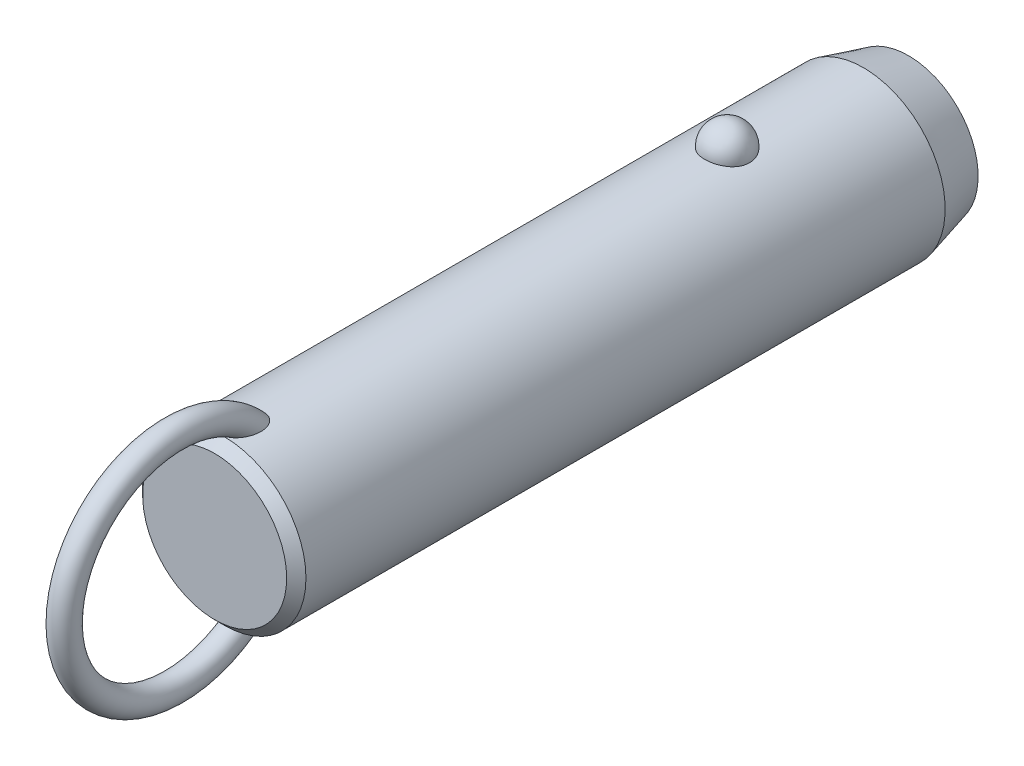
ISO-10303-21;
HEADER;
FILE_DESCRIPTION(('STEP AP214'),'2;1');
FILE_NAME('part.step','',(''),(''),'','','');
FILE_SCHEMA(('AUTOMOTIVE_DESIGN { 1 0 10303 214 1 1 1 1 }'));
ENDSEC;
DATA;
#1=APPLICATION_CONTEXT('core data for automotive mechanical design processes');
#2=APPLICATION_PROTOCOL_DEFINITION('international standard','automotive_design',2000,#1);
#3=PRODUCT_CONTEXT('',#1,'mechanical');
#4=PRODUCT('Part','Part','',(#3));
#5=PRODUCT_RELATED_PRODUCT_CATEGORY('part','',(#4));
#6=PRODUCT_DEFINITION_FORMATION('','',#4);
#7=PRODUCT_DEFINITION_CONTEXT('part definition',#1,'design');
#8=PRODUCT_DEFINITION('design','',#6,#7);
#9=PRODUCT_DEFINITION_SHAPE('','',#8);
#10=(LENGTH_UNIT() NAMED_UNIT(*) SI_UNIT(.MILLI.,.METRE.));
#11=(NAMED_UNIT(*) PLANE_ANGLE_UNIT() SI_UNIT($,.RADIAN.));
#12=(NAMED_UNIT(*) SI_UNIT($,.STERADIAN.) SOLID_ANGLE_UNIT());
#13=UNCERTAINTY_MEASURE_WITH_UNIT(LENGTH_MEASURE(1.E-05),#10,'distance_accuracy_value','');
#14=(GEOMETRIC_REPRESENTATION_CONTEXT(3) GLOBAL_UNCERTAINTY_ASSIGNED_CONTEXT((#13)) GLOBAL_UNIT_ASSIGNED_CONTEXT((#10,
#11,#12)) REPRESENTATION_CONTEXT('',''));
#15=CARTESIAN_POINT('',(0.,0.,0.));
#16=DIRECTION('',(0.,0.,1.));
#17=DIRECTION('',(1.,0.,0.));
#18=AXIS2_PLACEMENT_3D('',#15,#16,#17);
#19=CARTESIAN_POINT('',(0.,0.,63.5));
#20=DIRECTION('',(0.,0.,-1.));
#21=DIRECTION('',(-1.,0.,0.));
#22=AXIS2_PLACEMENT_3D('',#19,#20,#21);
#23=CYLINDRICAL_SURFACE('',#22,12.7);
#24=CARTESIAN_POINT('',(3.46661256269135,12.2177165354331,-3.5));
#25=CARTESIAN_POINT('',(3.4666090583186,12.2177194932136,-3.30432790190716));
#26=CARTESIAN_POINT('',(3.45063567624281,12.2222841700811,-3.10861112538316));
#27=CARTESIAN_POINT('',(3.38712451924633,12.2400345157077,-2.72271899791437));
#28=CARTESIAN_POINT('',(3.33957415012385,12.2532236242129,-2.53254588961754));
#29=CARTESIAN_POINT('',(3.2141234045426,12.286724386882,-2.16324948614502));
#30=CARTESIAN_POINT('',(3.13623639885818,12.3070329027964,-1.98412136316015));
#31=CARTESIAN_POINT('',(2.95205930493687,12.3525018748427,-1.64180592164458));
#32=CARTESIAN_POINT('',(2.84577003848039,12.3776621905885,-1.47861814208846));
#33=CARTESIAN_POINT('',(2.60688050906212,12.4301712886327,-1.17190583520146));
#34=CARTESIAN_POINT('',(2.47415697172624,12.4575299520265,-1.02847897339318));
#35=CARTESIAN_POINT('',(2.18615174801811,12.5112810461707,-0.766177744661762));
#36=CARTESIAN_POINT('',(2.03087002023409,12.5376734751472,-0.64730342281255));
#37=CARTESIAN_POINT('',(1.70237334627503,12.5864761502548,-0.437732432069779));
#38=CARTESIAN_POINT('',(1.52920948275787,12.6088972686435,-0.346958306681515));
#39=CARTESIAN_POINT('',(1.16944170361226,12.6473352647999,-0.195750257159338));
#40=CARTESIAN_POINT('',(0.982839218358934,12.663352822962,-0.135313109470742));
#41=CARTESIAN_POINT('',(0.604961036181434,12.6869706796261,-0.0473241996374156));
#42=CARTESIAN_POINT('',(0.41382314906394,12.6947125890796,-0.0192185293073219));
#43=CARTESIAN_POINT('',(0.0293827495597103,12.7014203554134,0.0051725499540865));
#44=CARTESIAN_POINT('',(-0.163919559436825,12.7003870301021,0.00146092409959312));
#45=CARTESIAN_POINT('',(-0.544374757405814,12.689735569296,-0.0373939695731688));
#46=CARTESIAN_POINT('',(-0.731575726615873,12.6802364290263,-0.0721015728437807));
#47=CARTESIAN_POINT('',(-1.09733277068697,12.6538333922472,-0.171364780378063));
#48=CARTESIAN_POINT('',(-1.27588869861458,12.6369293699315,-0.235920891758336));
#49=CARTESIAN_POINT('',(-1.6204698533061,12.5973946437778,-0.393548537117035));
#50=CARTESIAN_POINT('',(-1.78641865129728,12.5747321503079,-0.486778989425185));
#51=CARTESIAN_POINT('',(-2.10030671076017,12.5261316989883,-0.699110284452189));
#52=CARTESIAN_POINT('',(-2.24824419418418,12.5001934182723,-0.818213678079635));
#53=CARTESIAN_POINT('',(-2.52491489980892,12.4472906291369,-1.08157124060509));
#54=CARTESIAN_POINT('',(-2.65324222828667,12.4203160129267,-1.22624992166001));
#55=CARTESIAN_POINT('',(-2.88410007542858,12.3687509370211,-1.53528325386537));
#56=CARTESIAN_POINT('',(-2.98662883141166,12.3441606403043,-1.69963924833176));
#57=CARTESIAN_POINT('',(-3.16432417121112,12.2998199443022,-2.04548497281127));
#58=CARTESIAN_POINT('',(-3.23917525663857,12.2801261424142,-2.22714424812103));
#59=CARTESIAN_POINT('',(-3.35800573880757,12.248167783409,-2.6009138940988));
#60=CARTESIAN_POINT('',(-3.4019860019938,12.2359030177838,-2.79302397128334));
#61=CARTESIAN_POINT('',(-3.45784812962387,12.2202347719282,-3.18140279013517));
#62=CARTESIAN_POINT('',(-3.46986123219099,12.2167950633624,-3.37765118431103));
#63=CARTESIAN_POINT('',(-3.46186273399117,12.2190638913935,-3.76943689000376));
#64=CARTESIAN_POINT('',(-3.44185196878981,12.2247721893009,-3.96497421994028));
#65=CARTESIAN_POINT('',(-3.37048652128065,12.2446381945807,-4.34881728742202));
#66=CARTESIAN_POINT('',(-3.31928253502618,12.2587552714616,-4.53715319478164));
#67=CARTESIAN_POINT('',(-3.18693461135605,12.2938237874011,-4.90231727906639));
#68=CARTESIAN_POINT('',(-3.1057895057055,12.3147754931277,-5.07914500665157));
#69=CARTESIAN_POINT('',(-2.91506431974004,12.3613125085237,-5.41732059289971));
#70=CARTESIAN_POINT('',(-2.80533587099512,12.3869217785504,-5.57858147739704));
#71=CARTESIAN_POINT('',(-2.560414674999,12.4398525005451,-5.88013283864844));
#72=CARTESIAN_POINT('',(-2.42522099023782,12.4671740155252,-6.02042254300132));
#73=CARTESIAN_POINT('',(-2.1323357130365,12.5205965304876,-6.27662798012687));
#74=CARTESIAN_POINT('',(-1.97456596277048,12.5466928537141,-6.3924554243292));
#75=CARTESIAN_POINT('',(-1.64115839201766,12.5946384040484,-6.59583547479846));
#76=CARTESIAN_POINT('',(-1.46552179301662,12.6164879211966,-6.68339001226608));
#77=CARTESIAN_POINT('',(-1.10356050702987,12.6532533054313,-6.82682153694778));
#78=CARTESIAN_POINT('',(-0.9173913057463,12.6682500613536,-6.8830698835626));
#79=CARTESIAN_POINT('',(-0.537836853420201,12.6900288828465,-6.96386887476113));
#80=CARTESIAN_POINT('',(-0.344452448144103,12.6968119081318,-6.9884232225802));
#81=CARTESIAN_POINT('',(0.0402577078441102,12.7013667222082,-7.00496469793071));
#82=CARTESIAN_POINT('',(0.231556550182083,12.6993008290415,-6.99753844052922));
#83=CARTESIAN_POINT('',(0.610105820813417,12.6867505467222,-6.9516636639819));
#84=CARTESIAN_POINT('',(0.797356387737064,12.6762664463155,-6.913216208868));
#85=CARTESIAN_POINT('',(1.16186657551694,12.6480587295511,-6.80658431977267));
#86=CARTESIAN_POINT('',(1.33915951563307,12.6303611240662,-6.73850666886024));
#87=CARTESIAN_POINT('',(1.67968518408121,12.5896027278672,-6.5745087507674));
#88=CARTESIAN_POINT('',(1.84291705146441,12.5665416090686,-6.47858678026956));
#89=CARTESIAN_POINT('',(2.15340192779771,12.5171072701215,-6.25982455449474));
#90=CARTESIAN_POINT('',(2.30037831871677,12.4906895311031,-6.13660186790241));
#91=CARTESIAN_POINT('',(2.5717412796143,12.4376567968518,-5.86739587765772));
#92=CARTESIAN_POINT('',(2.69612388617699,12.4110417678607,-5.72140858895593));
#93=CARTESIAN_POINT('',(2.92107785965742,12.360051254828,-5.40794137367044));
#94=CARTESIAN_POINT('',(3.02121329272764,12.3357209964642,-5.24014110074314));
#95=CARTESIAN_POINT('',(3.19236291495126,12.2925446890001,-4.88969865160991));
#96=CARTESIAN_POINT('',(3.26338839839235,12.2736965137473,-4.70706226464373));
#97=CARTESIAN_POINT('',(3.36788038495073,12.245404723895,-4.35469510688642));
#98=CARTESIAN_POINT('',(3.40484026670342,12.2351018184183,-4.18605935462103));
#99=CARTESIAN_POINT('',(3.45420764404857,12.2212564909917,-3.84496058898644));
#100=CARTESIAN_POINT('',(3.46661565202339,12.2177139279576,-3.67249765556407));
#101=CARTESIAN_POINT('',(3.46661256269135,12.2177165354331,-3.5));
#102=B_SPLINE_CURVE_WITH_KNOTS('',3,(#24,#25,#26,#27,#28,#29,#30,#31,#32,#33,#34,#35,#36,#37,
#38,#39,#40,#41,#42,#43,#44,#45,#46,#47,#48,#49,#50,#51,#52,#53,#54,#55,#56,#57,#58,#59,#60,#61,
#62,#63,#64,#65,#66,#67,#68,#69,#70,#71,#72,#73,#74,#75,#76,#77,#78,#79,#80,#81,#82,#83,#84,#85,
#86,#87,#88,#89,#90,#91,#92,#93,#94,#95,#96,#97,#98,#99,#100,#101),.UNSPECIFIED.,.T.,.F.,(4,2,2,
2,2,2,2,2,2,2,2,2,2,2,2,2,2,2,2,2,2,2,2,2,2,2,2,2,2,2,2,2,2,2,2,2,2,2,4),(0.,0.586396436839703,
1.17302689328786,1.7593990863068,2.34575431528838,2.93491084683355,3.52406845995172,
4.11158733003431,4.69904375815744,5.2762784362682,5.85345931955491,6.42265312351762,
6.99185659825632,7.56427334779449,8.136746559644,8.71981013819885,9.3029135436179,
9.89247258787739,10.4820150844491,11.0691335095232,11.6562366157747,12.2405256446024,
12.8248374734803,13.412244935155,13.9996740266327,14.5891883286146,15.1786623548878,
15.7609861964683,16.3432419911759,16.9148635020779,17.4864654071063,18.0560241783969,
18.6256177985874,19.2037609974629,19.7820055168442,20.3699810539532,20.957728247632,
21.4746855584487,21.9916320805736),.UNSPECIFIED.);
#103=CARTESIAN_POINT('',(3.46661256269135,12.2177165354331,-3.5));
#104=VERTEX_POINT('',#103);
#105=EDGE_CURVE('E41',#104,#104,#102,.T.);
#106=ORIENTED_EDGE('',*,*,#105,.T.);
#107=EDGE_LOOP('',(#106));
#108=FACE_BOUND('',#107,.T.);
#109=CARTESIAN_POINT('',(0.,0.,74.7));
#110=DIRECTION('',(0.,0.,1.));
#111=DIRECTION('',(1.,0.,0.));
#112=AXIS2_PLACEMENT_3D('',#109,#110,#111);
#113=CIRCLE('',#112,12.7);
#114=CARTESIAN_POINT('',(12.7,0.,74.7));
#115=VERTEX_POINT('',#114);
#116=EDGE_CURVE('E10',#115,#115,#113,.F.);
#117=ORIENTED_EDGE('',*,*,#116,.T.);
#118=EDGE_LOOP('',(#117));
#119=FACE_BOUND('',#118,.T.);
#120=CARTESIAN_POINT('',(-0.548122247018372,-12.6881662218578,68.4432187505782));
#121=CARTESIAN_POINT('',(-0.648865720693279,-12.6838128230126,68.477926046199));
#122=CARTESIAN_POINT('',(-0.746398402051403,-12.6783867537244,68.5220428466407));
#123=CARTESIAN_POINT('',(-0.93212506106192,-12.666091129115,68.6267647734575));
#124=CARTESIAN_POINT('',(-1.02030388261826,-12.6592192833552,68.687396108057));
#125=CARTESIAN_POINT('',(-1.18487740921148,-12.6448747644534,68.821847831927));
#126=CARTESIAN_POINT('',(-1.26134296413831,-12.637406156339,68.8955825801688));
#127=CARTESIAN_POINT('',(-1.4023120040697,-12.6225412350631,69.0536045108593));
#128=CARTESIAN_POINT('',(-1.46681470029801,-12.6151449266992,69.1378923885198));
#129=CARTESIAN_POINT('',(-1.60714786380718,-12.5981718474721,69.3496577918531));
#130=CARTESIAN_POINT('',(-1.67725126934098,-12.588900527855,69.480962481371));
#131=CARTESIAN_POINT('',(-1.79536591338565,-12.5725964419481,69.7532471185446));
#132=CARTESIAN_POINT('',(-1.84333535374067,-12.5655679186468,69.8942447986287));
#133=CARTESIAN_POINT('',(-1.93422576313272,-12.5519624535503,70.2376455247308));
#134=CARTESIAN_POINT('',(-1.96788773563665,-12.5466298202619,70.4425578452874));
#135=CARTESIAN_POINT('',(-1.9941399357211,-12.542463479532,70.7517600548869));
#136=CARTESIAN_POINT('',(-1.99883864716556,-12.5417153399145,70.8552987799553));
#137=CARTESIAN_POINT('',(-2.00078003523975,-12.5414074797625,71.0624512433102));
#138=CARTESIAN_POINT('',(-1.99802449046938,-12.5418474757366,71.1660649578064));
#139=CARTESIAN_POINT('',(-1.98336733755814,-12.5441750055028,71.4103207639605));
#140=CARTESIAN_POINT('',(-1.96851430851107,-12.5465291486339,71.5507804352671));
#141=CARTESIAN_POINT('',(-1.92707089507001,-12.5529612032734,71.8299607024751));
#142=CARTESIAN_POINT('',(-1.90047458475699,-12.5570399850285,71.9686803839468));
#143=CARTESIAN_POINT('',(-1.83619120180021,-12.5666008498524,72.2434113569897));
#144=CARTESIAN_POINT('',(-1.79850828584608,-12.57208240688,72.3794236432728));
#145=CARTESIAN_POINT('',(-1.71223796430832,-12.5841228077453,72.6478421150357));
#146=CARTESIAN_POINT('',(-1.66365679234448,-12.5906810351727,72.7802503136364));
#147=CARTESIAN_POINT('',(-1.5780450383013,-12.6016176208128,72.9854887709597));
#148=CARTESIAN_POINT('',(-1.54477252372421,-12.6057501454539,73.0599149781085));
#149=CARTESIAN_POINT('',(-1.47424480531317,-12.6141930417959,73.2068393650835));
#150=CARTESIAN_POINT('',(-1.43699041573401,-12.6185033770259,73.2793379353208));
#151=CARTESIAN_POINT('',(-1.35825795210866,-12.6272207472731,73.4218926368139));
#152=CARTESIAN_POINT('',(-1.31678520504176,-12.6316276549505,73.4919517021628));
#153=CARTESIAN_POINT('',(-1.22917793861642,-12.6404532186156,73.6290705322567));
#154=CARTESIAN_POINT('',(-1.18304514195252,-12.6448718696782,73.6961313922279));
#155=CARTESIAN_POINT('',(-1.07246411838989,-12.6547893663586,73.8438741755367));
#156=CARTESIAN_POINT('',(-1.00642239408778,-12.6602600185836,73.9233844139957));
#157=CARTESIAN_POINT('',(-0.864441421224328,-12.6707460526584,74.0731698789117));
#158=CARTESIAN_POINT('',(-0.78851691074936,-12.6757620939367,74.1434585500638));
#159=CARTESIAN_POINT('',(-0.652215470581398,-12.6833591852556,74.2486801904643));
#160=CARTESIAN_POINT('',(-0.594982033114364,-12.6861973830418,74.2876241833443));
#161=CARTESIAN_POINT('',(-0.475269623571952,-12.6912445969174,74.3564899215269));
#162=CARTESIAN_POINT('',(-0.412800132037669,-12.6934547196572,74.3864275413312));
#163=CARTESIAN_POINT('',(-0.295749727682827,-12.6966636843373,74.4297565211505));
#164=CARTESIAN_POINT('',(-0.241949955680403,-12.6978134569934,74.4452188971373));
#165=CARTESIAN_POINT('',(-0.132508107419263,-12.6994261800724,74.4668845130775));
#166=CARTESIAN_POINT('',(-0.0768679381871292,-12.6998898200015,74.4730970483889));
#167=CARTESIAN_POINT('',(0.0347696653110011,-12.7000752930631,74.4755838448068));
#168=CARTESIAN_POINT('',(0.0907676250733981,-12.6997954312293,74.4718353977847));
#169=CARTESIAN_POINT('',(0.201283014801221,-12.6985255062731,74.4547883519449));
#170=CARTESIAN_POINT('',(0.255799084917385,-12.6975348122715,74.4414812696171));
#171=CARTESIAN_POINT('',(0.376042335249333,-12.6946091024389,74.4020379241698));
#172=CARTESIAN_POINT('',(0.44095085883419,-12.6924943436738,74.3734492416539));
#173=CARTESIAN_POINT('',(0.565350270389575,-12.6875639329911,74.3063234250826));
#174=CARTESIAN_POINT('',(0.624828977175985,-12.6847467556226,74.2677646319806));
#175=CARTESIAN_POINT('',(0.774116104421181,-12.6767252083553,74.156949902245));
#176=CARTESIAN_POINT('',(0.859449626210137,-12.6711344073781,74.0787605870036));
#177=CARTESIAN_POINT('',(1.01789440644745,-12.6593922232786,73.910943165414));
#178=CARTESIAN_POINT('',(1.09096902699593,-12.653239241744,73.821282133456));
#179=CARTESIAN_POINT('',(1.22268793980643,-12.6411674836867,73.6402658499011));
#180=CARTESIAN_POINT('',(1.28193986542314,-12.6352572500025,73.549345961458));
#181=CARTESIAN_POINT('',(1.39259777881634,-12.6235401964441,73.3627929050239));
#182=CARTESIAN_POINT('',(1.44399707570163,-12.6177334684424,73.2671558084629));
#183=CARTESIAN_POINT('',(1.53972870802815,-12.6064093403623,73.0722738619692));
#184=CARTESIAN_POINT('',(1.58405262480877,-12.6008922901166,72.9730248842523));
#185=CARTESIAN_POINT('',(1.66600705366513,-12.5903187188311,72.7717727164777));
#186=CARTESIAN_POINT('',(1.70363651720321,-12.5852622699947,72.6697690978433));
#187=CARTESIAN_POINT('',(1.77545379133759,-12.5753406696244,72.4543580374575));
#188=CARTESIAN_POINT('',(1.80903453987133,-12.5705328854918,72.340745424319));
#189=CARTESIAN_POINT('',(1.86844163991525,-12.5618400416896,72.1114575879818));
#190=CARTESIAN_POINT('',(1.89426665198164,-12.5579551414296,71.9957820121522));
#191=CARTESIAN_POINT('',(1.9378546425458,-12.5513030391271,71.7630072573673));
#192=CARTESIAN_POINT('',(1.9556264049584,-12.5485346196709,71.6459097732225));
#193=CARTESIAN_POINT('',(1.98264463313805,-12.5442934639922,71.4107473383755));
#194=CARTESIAN_POINT('',(1.99189298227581,-12.5428204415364,71.2926826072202));
#195=CARTESIAN_POINT('',(2.00416068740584,-12.540871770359,70.9806225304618));
#196=CARTESIAN_POINT('',(1.99944433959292,-12.541631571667,70.7862290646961));
#197=CARTESIAN_POINT('',(1.96113755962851,-12.5476846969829,70.4003095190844));
#198=CARTESIAN_POINT('',(1.92758341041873,-12.5529723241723,70.2087801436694));
#199=CARTESIAN_POINT('',(1.83934342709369,-12.5661532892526,69.8822728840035));
#200=CARTESIAN_POINT('',(1.79215440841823,-12.5730485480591,69.7452499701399));
#201=CARTESIAN_POINT('',(1.67676242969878,-12.588958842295,69.4804459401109));
#202=CARTESIAN_POINT('',(1.60859050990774,-12.597970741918,69.3526515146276));
#203=CARTESIAN_POINT('',(1.46583832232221,-12.6152829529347,69.1358006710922));
#204=CARTESIAN_POINT('',(1.39525727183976,-12.6233659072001,69.0441050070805));
#205=CARTESIAN_POINT('',(1.23992594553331,-12.6395676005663,68.8734854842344));
#206=CARTESIAN_POINT('',(1.1551793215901,-12.6476863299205,68.7945583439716));
#207=CARTESIAN_POINT('',(0.971995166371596,-12.6630846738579,68.6526438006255));
#208=CARTESIAN_POINT('',(0.873456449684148,-12.6703572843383,68.5897849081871));
#209=CARTESIAN_POINT('',(0.665847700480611,-12.6829569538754,68.4844870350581));
#210=CARTESIAN_POINT('',(0.556784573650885,-12.688285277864,68.4420347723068));
#211=CARTESIAN_POINT('',(0.347338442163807,-12.6956226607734,68.3844434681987));
#212=CARTESIAN_POINT('',(0.247759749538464,-12.6979816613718,68.3663996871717));
#213=CARTESIAN_POINT('',(0.0470218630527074,-12.7003077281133,68.348600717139));
#214=CARTESIAN_POINT('',(-0.0541350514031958,-12.7002779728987,68.3488212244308));
#215=CARTESIAN_POINT('',(-0.221414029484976,-12.6982482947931,68.3643639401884));
#216=CARTESIAN_POINT('',(-0.288055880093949,-12.6969033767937,68.3746662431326));
#217=CARTESIAN_POINT('',(-0.419599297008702,-12.6932369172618,68.4031348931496));
#218=CARTESIAN_POINT('',(-0.484501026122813,-12.6909154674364,68.4213005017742));
#219=CARTESIAN_POINT('',(-0.548122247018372,-12.6881662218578,68.4432187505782));
#220=B_SPLINE_CURVE_WITH_KNOTS('',3,(#120,#121,#122,#123,#124,#125,#126,#127,#128,#129,#130,
#131,#132,#133,#134,#135,#136,#137,#138,#139,#140,#141,#142,#143,#144,#145,#146,#147,#148,#149,
#150,#151,#152,#153,#154,#155,#156,#157,#158,#159,#160,#161,#162,#163,#164,#165,#166,#167,#168,
#169,#170,#171,#172,#173,#174,#175,#176,#177,#178,#179,#180,#181,#182,#183,#184,#185,#186,#187,
#188,#189,#190,#191,#192,#193,#194,#195,#196,#197,#198,#199,#200,#201,#202,#203,#204,#205,#206,
#207,#208,#209,#210,#211,#212,#213,#214,#215,#216,#217,#218,#219),.UNSPECIFIED.,.T.,.F.,(4,2,2,
2,2,2,2,2,2,2,2,2,2,2,2,2,2,2,2,2,2,2,2,2,2,2,2,2,2,2,2,2,2,2,2,2,2,2,2,2,2,2,2,2,2,2,2,2,2,4),
(0.,0.31964225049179,0.639794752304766,0.957927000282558,1.27608021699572,1.72100165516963,
2.16675988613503,2.78630021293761,3.0970578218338,3.40774128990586,3.83096358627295,
4.2543996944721,4.67767724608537,5.10071330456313,5.34550297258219,5.59024267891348,
5.83467707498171,6.07902143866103,6.38891080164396,6.69834321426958,6.90560910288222,
7.11250749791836,7.27977315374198,7.44687060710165,7.61434932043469,7.78197685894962,
7.99365544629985,8.20579780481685,8.55147335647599,8.89816429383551,9.22375138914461,
9.5496143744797,9.87586224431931,10.202161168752,10.557587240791,10.9130746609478,
11.2681734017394,11.6231936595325,12.2046601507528,12.7853961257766,13.219164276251,
13.6522938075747,13.9989174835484,14.3454519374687,14.6946768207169,15.0436740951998,
15.3457513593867,15.6474266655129,15.8493051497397,16.0511646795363),.UNSPECIFIED.);
#221=CARTESIAN_POINT('',(-0.548122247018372,-12.6881662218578,68.4432187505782));
#222=VERTEX_POINT('',#221);
#223=EDGE_CURVE('E60',#222,#222,#220,.T.);
#224=ORIENTED_EDGE('',*,*,#223,.T.);
#225=EDGE_LOOP('',(#224));
#226=FACE_BOUND('',#225,.T.);
#227=CARTESIAN_POINT('',(-0.548122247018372,12.6881662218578,68.4432187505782));
#228=CARTESIAN_POINT('',(-0.459436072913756,12.6919968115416,68.412673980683));
#229=CARTESIAN_POINT('',(-0.368189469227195,12.6949996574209,68.3893913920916));
#230=CARTESIAN_POINT('',(-0.183024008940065,12.6990186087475,68.3584062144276));
#231=CARTESIAN_POINT('',(-0.0891049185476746,12.7000345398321,68.3507049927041));
#232=CARTESIAN_POINT('',(0.0987147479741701,12.6999636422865,68.3512455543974));
#233=CARTESIAN_POINT('',(0.192615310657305,12.6988761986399,68.3594920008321));
#234=CARTESIAN_POINT('',(0.377658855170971,12.6947211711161,68.3915515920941));
#235=CARTESIAN_POINT('',(0.468801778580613,12.6916535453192,68.4153650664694));
#236=CARTESIAN_POINT('',(0.645809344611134,12.6838788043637,68.4774565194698));
#237=CARTESIAN_POINT('',(0.731679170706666,12.6791733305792,68.515720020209));
#238=CARTESIAN_POINT('',(0.896315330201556,12.6686004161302,68.605120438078));
#239=CARTESIAN_POINT('',(0.975080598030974,12.6627328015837,68.6562592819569));
#240=CARTESIAN_POINT('',(1.12963655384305,12.6499161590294,68.7736782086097));
#241=CARTESIAN_POINT('',(1.20478673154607,12.6429194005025,68.8407929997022));
#242=CARTESIAN_POINT('',(1.34448241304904,12.6288282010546,68.9852250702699));
#243=CARTESIAN_POINT('',(1.40902173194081,12.621733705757,69.0625482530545));
#244=CARTESIAN_POINT('',(1.55208211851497,12.6050877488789,69.2592475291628));
#245=CARTESIAN_POINT('',(1.62510490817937,12.5957546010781,69.3826540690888));
#246=CARTESIAN_POINT('',(1.7501904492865,12.5789823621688,69.6397690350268));
#247=CARTESIAN_POINT('',(1.80221377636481,12.5715468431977,69.773496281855));
#248=CARTESIAN_POINT('',(1.90309965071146,12.5567434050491,70.0983516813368));
#249=CARTESIAN_POINT('',(1.94342317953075,12.5504515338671,70.2921611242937));
#250=CARTESIAN_POINT('',(1.99332997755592,12.5426147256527,70.6837881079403));
#251=CARTESIAN_POINT('',(2.00285305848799,12.5410790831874,70.8816127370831));
#252=CARTESIAN_POINT('',(1.99678999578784,12.5420407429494,71.2166427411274));
#253=CARTESIAN_POINT('',(1.98794117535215,12.5434564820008,71.3540428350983));
#254=CARTESIAN_POINT('',(1.95865119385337,12.5480641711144,71.6276394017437));
#255=CARTESIAN_POINT('',(1.93820436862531,12.5512569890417,71.7638352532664));
#256=CARTESIAN_POINT('',(1.88647896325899,12.5591352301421,72.0342493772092));
#257=CARTESIAN_POINT('',(1.85518800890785,12.5638223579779,72.1684652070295));
#258=CARTESIAN_POINT('',(1.78217886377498,12.5743868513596,72.4339362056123));
#259=CARTESIAN_POINT('',(1.74046509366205,12.5802637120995,72.5651926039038));
#260=CARTESIAN_POINT('',(1.66024095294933,12.5910571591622,72.7860855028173));
#261=CARTESIAN_POINT('',(1.62434772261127,12.5957535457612,72.8766904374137));
#262=CARTESIAN_POINT('',(1.5470900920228,12.6054762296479,73.0555125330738));
#263=CARTESIAN_POINT('',(1.50572681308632,12.6105024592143,73.1437301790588));
#264=CARTESIAN_POINT('',(1.41728020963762,12.620748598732,73.3169321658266));
#265=CARTESIAN_POINT('',(1.37021377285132,12.625967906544,73.4019251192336));
#266=CARTESIAN_POINT('',(1.2696962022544,12.6364721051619,73.5680072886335));
#267=CARTESIAN_POINT('',(1.21624929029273,12.6417569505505,73.6490990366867));
#268=CARTESIAN_POINT('',(1.10304413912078,12.6521331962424,73.8047027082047));
#269=CARTESIAN_POINT('',(1.04340936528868,12.657226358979,73.8793033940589));
#270=CARTESIAN_POINT('',(0.91591933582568,12.6670906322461,74.021324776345));
#271=CARTESIAN_POINT('',(0.84806456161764,12.6718617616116,74.0887458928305));
#272=CARTESIAN_POINT('',(0.717035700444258,12.67987711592,74.2006247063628));
#273=CARTESIAN_POINT('',(0.655526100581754,12.6832377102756,74.2469970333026));
#274=CARTESIAN_POINT('',(0.525985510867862,12.6892676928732,74.3296195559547));
#275=CARTESIAN_POINT('',(0.45796984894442,12.6919386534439,74.3658927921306));
#276=CARTESIAN_POINT('',(0.334859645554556,12.695691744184,74.4166572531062));
#277=CARTESIAN_POINT('',(0.281116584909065,12.6970073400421,74.4343733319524));
#278=CARTESIAN_POINT('',(0.171425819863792,12.6989609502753,74.4606429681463));
#279=CARTESIAN_POINT('',(0.11548082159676,12.699599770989,74.4692074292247));
#280=CARTESIAN_POINT('',(0.00272618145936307,12.7001251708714,74.4762531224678));
#281=CARTESIAN_POINT('',(-0.0540859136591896,12.7000089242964,74.4746964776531));
#282=CARTESIAN_POINT('',(-0.166544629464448,12.6990328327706,74.4616005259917));
#283=CARTESIAN_POINT('',(-0.222190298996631,12.6981724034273,74.4500533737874));
#284=CARTESIAN_POINT('',(-0.342018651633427,12.695562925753,74.4149128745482));
#285=CARTESIAN_POINT('',(-0.405606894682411,12.6936676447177,74.3893322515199));
#286=CARTESIAN_POINT('',(-0.527815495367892,12.6891754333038,74.3283111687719));
#287=CARTESIAN_POINT('',(-0.586425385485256,12.6865770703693,74.2928505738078));
#288=CARTESIAN_POINT('',(-0.731842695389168,12.6792129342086,74.1914960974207));
#289=CARTESIAN_POINT('',(-0.814709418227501,12.6740767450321,74.1200395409));
#290=CARTESIAN_POINT('',(-0.969101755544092,12.6632083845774,73.9658900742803));
#291=CARTESIAN_POINT('',(-1.04059564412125,12.6574746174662,73.8831668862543));
#292=CARTESIAN_POINT('',(-1.1698111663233,12.6461638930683,73.7158096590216));
#293=CARTESIAN_POINT('',(-1.22811369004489,12.6405994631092,73.6316166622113));
#294=CARTESIAN_POINT('',(-1.33743405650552,12.6295007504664,73.4585791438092));
#295=CARTESIAN_POINT('',(-1.38844577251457,12.6239664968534,73.3697307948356));
#296=CARTESIAN_POINT('',(-1.48400702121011,12.6130898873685,73.188389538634));
#297=CARTESIAN_POINT('',(-1.52854232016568,12.6077479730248,73.0958891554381));
#298=CARTESIAN_POINT('',(-1.6115011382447,12.5974127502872,72.9081607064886));
#299=CARTESIAN_POINT('',(-1.64992317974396,12.5924195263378,72.8129319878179));
#300=CARTESIAN_POINT('',(-1.73468589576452,12.581070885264,72.5828936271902));
#301=CARTESIAN_POINT('',(-1.77831261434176,12.5749388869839,72.4470661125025));
#302=CARTESIAN_POINT('',(-1.85439734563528,12.5639437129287,72.1722128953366));
#303=CARTESIAN_POINT('',(-1.88684994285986,12.5590811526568,72.0331856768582));
#304=CARTESIAN_POINT('',(-1.94008483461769,12.550968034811,71.7530923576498));
#305=CARTESIAN_POINT('',(-1.96088706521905,12.5477147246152,71.6120301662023));
#306=CARTESIAN_POINT('',(-1.99000539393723,12.5431291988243,71.3286689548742));
#307=CARTESIAN_POINT('',(-1.99832911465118,12.5417958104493,71.1863707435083));
#308=CARTESIAN_POINT('',(-2.00166624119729,12.5412674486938,70.8576271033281));
#309=CARTESIAN_POINT('',(-1.99178843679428,12.5428579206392,70.671088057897));
#310=CARTESIAN_POINT('',(-1.9445518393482,12.5502731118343,70.3016240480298));
#311=CARTESIAN_POINT('',(-1.90724032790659,12.5560905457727,70.1186934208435));
#312=CARTESIAN_POINT('',(-1.81330718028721,12.5699462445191,69.8048488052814));
#313=CARTESIAN_POINT('',(-1.76338820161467,12.5771273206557,69.6719105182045));
#314=CARTESIAN_POINT('',(-1.64305018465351,12.593414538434,69.4156813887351));
#315=CARTESIAN_POINT('',(-1.57265346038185,12.6025185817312,69.292380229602));
#316=CARTESIAN_POINT('',(-1.42634956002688,12.6198178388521,69.0835648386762));
#317=CARTESIAN_POINT('',(-1.35423772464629,12.6278405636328,68.9953846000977));
#318=CARTESIAN_POINT('',(-1.19645664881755,12.6437632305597,68.832107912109));
#319=CARTESIAN_POINT('',(-1.11080536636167,12.6516633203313,68.7569944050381));
#320=CARTESIAN_POINT('',(-0.947219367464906,12.6648319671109,68.6378114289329));
#321=CARTESIAN_POINT('',(-0.871624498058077,12.670300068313,68.5905414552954));
#322=CARTESIAN_POINT('',(-0.714161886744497,12.6801492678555,68.5077413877));
#323=CARTESIAN_POINT('',(-0.632295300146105,12.684530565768,68.4722091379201));
#324=CARTESIAN_POINT('',(-0.548122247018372,12.6881662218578,68.4432187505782));
#325=B_SPLINE_CURVE_WITH_KNOTS('',3,(#227,#228,#229,#230,#231,#232,#233,#234,#235,#236,#237,
#238,#239,#240,#241,#242,#243,#244,#245,#246,#247,#248,#249,#250,#251,#252,#253,#254,#255,#256,
#257,#258,#259,#260,#261,#262,#263,#264,#265,#266,#267,#268,#269,#270,#271,#272,#273,#274,#275,
#276,#277,#278,#279,#280,#281,#282,#283,#284,#285,#286,#287,#288,#289,#290,#291,#292,#293,#294,
#295,#296,#297,#298,#299,#300,#301,#302,#303,#304,#305,#306,#307,#308,#309,#310,#311,#312,#313,
#314,#315,#316,#317,#318,#319,#320,#321,#322,#323,#324),.UNSPECIFIED.,.T.,.F.,(4,2,2,2,2,2,2,2,
2,2,2,2,2,2,2,2,2,2,2,2,2,2,2,2,2,2,2,2,2,2,2,2,2,2,2,2,2,2,2,2,2,2,2,2,2,2,2,2,4),(0.,
0.281328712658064,0.562682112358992,0.844117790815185,1.12555942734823,1.40671982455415,
1.68792232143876,1.98972294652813,2.29169886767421,2.72039860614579,3.14989948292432,
3.74084916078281,4.33295293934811,4.74554109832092,5.15833092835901,5.57159335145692,
5.98468079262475,6.2772277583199,6.56971484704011,6.86135609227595,7.15280542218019,
7.43927407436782,7.72572595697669,7.95635862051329,8.18646071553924,8.35559393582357,
8.52452541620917,8.69408946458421,8.86378678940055,9.06834348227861,9.27332014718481,
9.60010414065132,9.92778432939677,10.2350252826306,10.5425229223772,10.8506864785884,
11.1589244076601,11.5867893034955,12.0148612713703,12.4421984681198,12.8692745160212,
13.4279365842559,13.9856380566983,14.4107062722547,14.8353130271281,15.1765567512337,
15.5173516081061,15.7844129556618,16.051425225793),.UNSPECIFIED.);
#326=CARTESIAN_POINT('',(-0.548122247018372,12.6881662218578,68.4432187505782));
#327=VERTEX_POINT('',#326);
#328=EDGE_CURVE('E67',#327,#327,#325,.T.);
#329=ORIENTED_EDGE('',*,*,#328,.T.);
#330=EDGE_LOOP('',(#329));
#331=FACE_BOUND('',#330,.T.);
#332=CARTESIAN_POINT('',(0.,0.,-24.6999999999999));
#333=DIRECTION('',(0.,0.,-1.));
#334=DIRECTION('',(-1.,0.,0.));
#335=AXIS2_PLACEMENT_3D('',#332,#333,#334);
#336=CIRCLE('',#335,12.7);
#337=CARTESIAN_POINT('',(-12.7,0.,-24.6999999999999));
#338=VERTEX_POINT('',#337);
#339=EDGE_CURVE('E57',#338,#338,#336,.F.);
#340=ORIENTED_EDGE('',*,*,#339,.T.);
#341=EDGE_LOOP('',(#340));
#342=FACE_BOUND('',#341,.T.);
#343=ADVANCED_FACE('F37',(#108,#119,#226,#331,#342),#23,.T.);
#344=CARTESIAN_POINT('',(0.,0.,-31.7));
#345=DIRECTION('',(0.,0.,-1.));
#346=DIRECTION('',(-1.,0.,0.));
#347=AXIS2_PLACEMENT_3D('',#344,#345,#346);
#348=PLANE('',#347);
#349=CARTESIAN_POINT('',(0.,0.,-31.7));
#350=DIRECTION('',(0.,0.,-1.));
#351=DIRECTION('',(-1.,0.,0.));
#352=AXIS2_PLACEMENT_3D('',#349,#350,#351);
#353=CIRCLE('',#352,10.8243556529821);
#354=CARTESIAN_POINT('',(-10.8243556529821,0.,-31.7));
#355=VERTEX_POINT('',#354);
#356=EDGE_CURVE('E66',#355,#355,#353,.T.);
#357=ORIENTED_EDGE('',*,*,#356,.T.);
#358=EDGE_LOOP('',(#357));
#359=FACE_BOUND('',#358,.T.);
#360=ADVANCED_FACE('F85',(#359),#348,.T.);
#361=CARTESIAN_POINT('',(0.,0.,-31.7));
#362=DIRECTION('',(0.,0.,1.));
#363=DIRECTION('',(1.,0.,0.));
#364=AXIS2_PLACEMENT_3D('',#361,#362,#363);
#365=CONICAL_SURFACE('',#364,10.8243556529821,0.261799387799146);
#366=ORIENTED_EDGE('',*,*,#339,.F.);
#367=EDGE_LOOP('',(#366));
#368=FACE_BOUND('',#367,.T.);
#369=ORIENTED_EDGE('',*,*,#356,.F.);
#370=EDGE_LOOP('',(#369));
#371=FACE_BOUND('',#370,.T.);
#372=ADVANCED_FACE('F83',(#368,#371),#365,.T.);
#373=CARTESIAN_POINT('',(0.,0.,76.2));
#374=DIRECTION('',(0.,0.,1.));
#375=DIRECTION('',(1.,0.,0.));
#376=AXIS2_PLACEMENT_3D('',#373,#374,#375);
#377=PLANE('',#376);
#378=CARTESIAN_POINT('',(0.,0.,76.2));
#379=DIRECTION('',(0.,0.,1.));
#380=DIRECTION('',(1.,0.,0.));
#381=AXIS2_PLACEMENT_3D('',#378,#379,#380);
#382=CIRCLE('',#381,11.2);
#383=CARTESIAN_POINT('',(11.2,0.,76.2));
#384=VERTEX_POINT('',#383);
#385=EDGE_CURVE('E50',#384,#384,#382,.T.);
#386=ORIENTED_EDGE('',*,*,#385,.T.);
#387=EDGE_LOOP('',(#386));
#388=FACE_BOUND('',#387,.T.);
#389=ADVANCED_FACE('F77',(#388),#377,.T.);
#390=CARTESIAN_POINT('',(0.,0.,82.55));
#391=DIRECTION('',(1.,0.,0.));
#392=DIRECTION('',(0.,0.,-1.));
#393=AXIS2_PLACEMENT_3D('',#390,#391,#392);
#394=TOROIDAL_SURFACE('',#393,17.05,2.);
#395=ORIENTED_EDGE('',*,*,#328,.F.);
#396=EDGE_LOOP('',(#395));
#397=FACE_BOUND('',#396,.T.);
#398=ORIENTED_EDGE('',*,*,#223,.F.);
#399=EDGE_LOOP('',(#398));
#400=FACE_BOUND('',#399,.T.);
#401=ADVANCED_FACE('F73',(#397,#400),#394,.T.);
#402=CARTESIAN_POINT('',(0.,0.,76.2));
#403=DIRECTION('',(0.,0.,-1.));
#404=DIRECTION('',(-1.,0.,0.));
#405=AXIS2_PLACEMENT_3D('',#402,#403,#404);
#406=CONICAL_SURFACE('',#405,11.2,0.785398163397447);
#407=ORIENTED_EDGE('',*,*,#116,.F.);
#408=EDGE_LOOP('',(#407));
#409=FACE_BOUND('',#408,.T.);
#410=ORIENTED_EDGE('',*,*,#385,.F.);
#411=EDGE_LOOP('',(#410));
#412=FACE_BOUND('',#411,.T.);
#413=ADVANCED_FACE('F39',(#409,#412),#406,.T.);
#414=CARTESIAN_POINT('',(0.,12.7,-3.5));
#415=DIRECTION('',(0.,1.,0.));
#416=DIRECTION('',(0.,0.,-1.));
#417=AXIS2_PLACEMENT_3D('',#414,#415,#416);
#418=SPHERICAL_SURFACE('',#417,3.5);
#419=ORIENTED_EDGE('',*,*,#105,.F.);
#420=EDGE_LOOP('',(#419));
#421=FACE_BOUND('',#420,.T.);
#422=ADVANCED_FACE('F79',(#421),#418,.T.);
#423=CLOSED_SHELL('',(#343,#360,#372,#389,#401,#413,#422));
#424=MANIFOLD_SOLID_BREP('B2',#423);
#425=ADVANCED_BREP_SHAPE_REPRESENTATION('',(#18,#424),#14);
#426=SHAPE_DEFINITION_REPRESENTATION(#9,#425);
ENDSEC;
END-ISO-10303-21;
